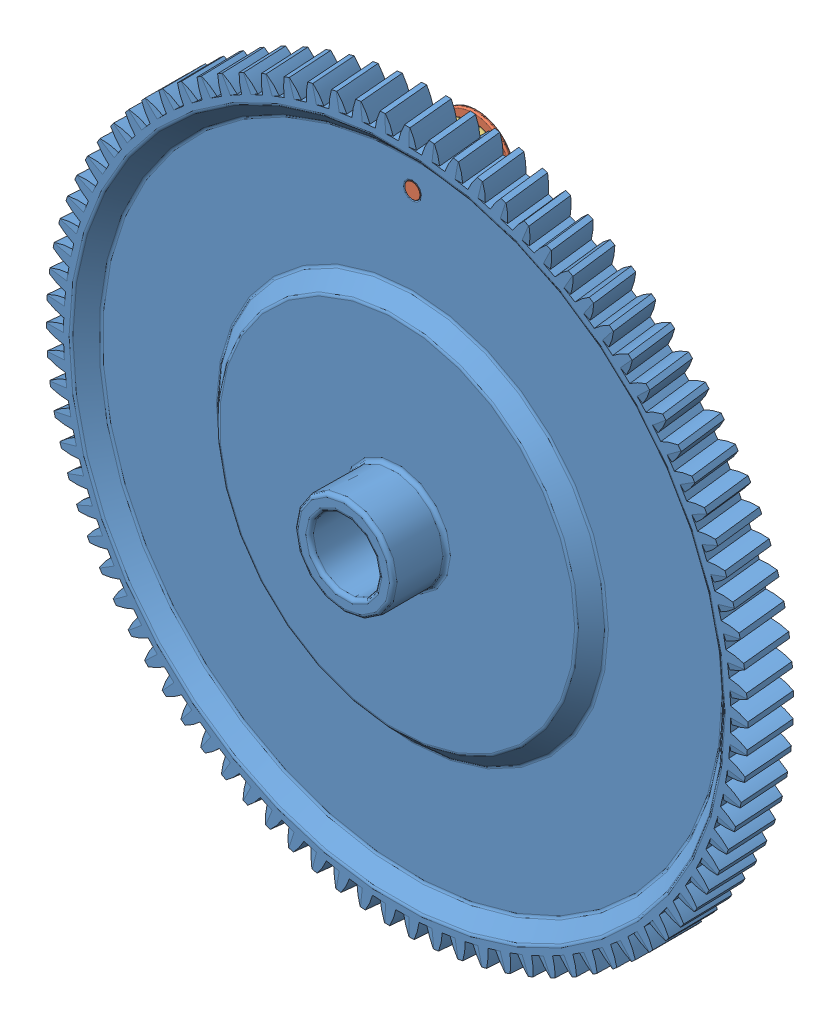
SolidWorks assembly Moby-RH-3-Projet.SLDASM, configuration Défaut (file format 4400). Lengths in mm.
Overall size (92.01 91.98 18.5).
3 component instances, 3 part files, 4 mates.
Components (placement in the parent):
- Moby-RH-3-1: Moby-RH-3.SLDPRT [Défaut] at (-43.9331 -18.4101 -1.5) size (92.01 91.98 17)
- Moby-Vis rond-M3-1: Moby-Vis rond-M3.SLDPRT [Défaut] at (-43.9331 18.5899 -0.5) x (0 0 -1) z (0.999991 -0.004268 0) size (9.5 10 10)
- Moby-Projet-Galet-H-1: Moby-Projet-Galet-H.SLDPRT [Défaut] at (-43.9331 18.5899 -4.5) x (-0.585442 0.810715 0) z (0 0 -1) size (10 10 4)
Mates (geometry in assembly coordinates):
- Coaxial1: concentric aligned: cylinder of Moby-RH-3-1 through (-43.9331 18.5899 -8.5) axis (0 0 1) radius 3; cylinder of Moby-Vis rond-M3-1 through (-43.9331 18.5899 -0.5) axis (0 0 1) radius 1.5
- Coïncidente1: coincident anti-aligned: plane of Moby-RH-3-1 through (-43.9331 18.5899 -8.5) normal (0 0 -1); plane of Moby-Vis rond-M3-1 through (-43.9267 20.0899 -8.5) normal (0 0 1)
- Coïncidente2: coincident anti-aligned: plane of Moby-RH-3-1 through (-43.9331 18.5899 -4.5) normal (0 0 -1); plane of Moby-Projet-Galet-H-1 through (-43.9331 18.5899 -4.5) normal (0 0 1)
- Coaxial2: concentric aligned: cylinder of Moby-RH-3-1 through (-43.9331 18.5899 -8.5) axis (0 0 1) radius 3; cylinder of Moby-Projet-Galet-H-1 through (-43.9331 18.5899 -7) axis (0 0 1) radius 5
